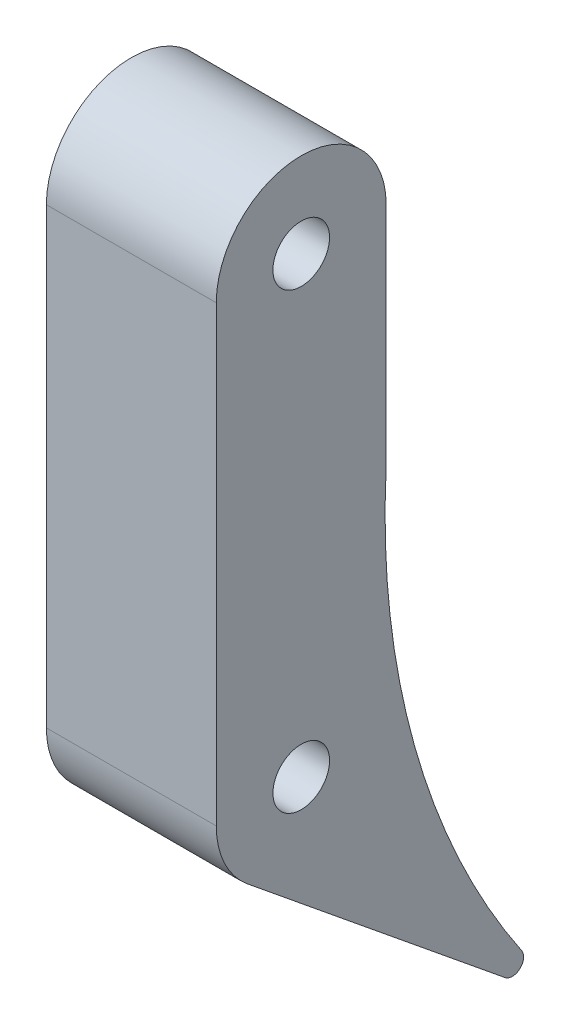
ISO-10303-21;
HEADER;
FILE_DESCRIPTION(('STEP AP214'),'2;1');
FILE_NAME('part.step','',(''),(''),'','','');
FILE_SCHEMA(('AUTOMOTIVE_DESIGN { 1 0 10303 214 1 1 1 1 }'));
ENDSEC;
DATA;
#1=APPLICATION_CONTEXT('core data for automotive mechanical design processes');
#2=APPLICATION_PROTOCOL_DEFINITION('international standard','automotive_design',2000,#1);
#3=PRODUCT_CONTEXT('',#1,'mechanical');
#4=PRODUCT('Part','Part','',(#3));
#5=PRODUCT_RELATED_PRODUCT_CATEGORY('part','',(#4));
#6=PRODUCT_DEFINITION_FORMATION('','',#4);
#7=PRODUCT_DEFINITION_CONTEXT('part definition',#1,'design');
#8=PRODUCT_DEFINITION('design','',#6,#7);
#9=PRODUCT_DEFINITION_SHAPE('','',#8);
#10=(LENGTH_UNIT() NAMED_UNIT(*) SI_UNIT(.MILLI.,.METRE.));
#11=(NAMED_UNIT(*) PLANE_ANGLE_UNIT() SI_UNIT($,.RADIAN.));
#12=(NAMED_UNIT(*) SI_UNIT($,.STERADIAN.) SOLID_ANGLE_UNIT());
#13=UNCERTAINTY_MEASURE_WITH_UNIT(LENGTH_MEASURE(1.E-05),#10,'distance_accuracy_value','');
#14=(GEOMETRIC_REPRESENTATION_CONTEXT(3) GLOBAL_UNCERTAINTY_ASSIGNED_CONTEXT((#13)) GLOBAL_UNIT_ASSIGNED_CONTEXT((#10,
#11,#12)) REPRESENTATION_CONTEXT('',''));
#15=CARTESIAN_POINT('',(0.,0.,0.));
#16=DIRECTION('',(0.,0.,1.));
#17=DIRECTION('',(1.,0.,0.));
#18=AXIS2_PLACEMENT_3D('',#15,#16,#17);
#19=CARTESIAN_POINT('',(7.5,0.,0.));
#20=DIRECTION('',(-1.,0.,0.));
#21=DIRECTION('',(0.,0.,1.));
#22=AXIS2_PLACEMENT_3D('',#19,#20,#21);
#23=PLANE('',#22);
#24=CARTESIAN_POINT('',(7.5,16.2707481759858,-77.4005914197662));
#25=DIRECTION('',(-1.,0.,0.));
#26=DIRECTION('',(0.,0.,1.));
#27=AXIS2_PLACEMENT_3D('',#24,#25,#26);
#28=CIRCLE('',#27,70.);
#29=CARTESIAN_POINT('',(7.5,-23.0123879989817,-19.4623897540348));
#30=VERTEX_POINT('',#29);
#31=CARTESIAN_POINT('',(7.5,19.7592987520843,-7.48757392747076));
#32=VERTEX_POINT('',#31);
#33=EDGE_CURVE('E110',#30,#32,#28,.T.);
#34=ORIENTED_EDGE('',*,*,#33,.T.);
#35=CARTESIAN_POINT('',(7.5,20.2576631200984,2.5));
#36=DIRECTION('',(-1.,0.,0.));
#37=DIRECTION('',(0.,0.,1.));
#38=AXIS2_PLACEMENT_3D('',#35,#36,#37);
#39=CIRCLE('',#38,10.);
#40=CARTESIAN_POINT('',(7.5,20.2576631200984,-7.5));
#41=VERTEX_POINT('',#40);
#42=EDGE_CURVE('E11',#32,#41,#39,.F.);
#43=ORIENTED_EDGE('',*,*,#42,.T.);
#44=DIRECTION('',(0.,1.,0.));
#45=VECTOR('',#44,1.);
#46=CARTESIAN_POINT('',(7.5,40.,-7.5));
#47=LINE('',#46,#45);
#48=CARTESIAN_POINT('',(7.5,40.,-7.5));
#49=VERTEX_POINT('',#48);
#50=EDGE_CURVE('E149',#41,#49,#47,.T.);
#51=ORIENTED_EDGE('',*,*,#50,.T.);
#52=CARTESIAN_POINT('',(7.5,40.,0.));
#53=DIRECTION('',(1.,0.,0.));
#54=DIRECTION('',(0.,0.,-1.));
#55=AXIS2_PLACEMENT_3D('',#52,#53,#54);
#56=CIRCLE('',#55,7.5);
#57=CARTESIAN_POINT('',(7.5,40.,7.5));
#58=VERTEX_POINT('',#57);
#59=EDGE_CURVE('E179',#49,#58,#56,.T.);
#60=ORIENTED_EDGE('',*,*,#59,.T.);
#61=DIRECTION('',(0.,-1.,0.));
#62=VECTOR('',#61,1.);
#63=CARTESIAN_POINT('',(7.5,0.,7.5));
#64=LINE('',#63,#62);
#65=CARTESIAN_POINT('',(7.5,0.,7.5));
#66=VERTEX_POINT('',#65);
#67=EDGE_CURVE('E116',#58,#66,#64,.T.);
#68=ORIENTED_EDGE('',*,*,#67,.T.);
#69=CARTESIAN_POINT('',(7.5,0.,0.));
#70=DIRECTION('',(1.,0.,0.));
#71=DIRECTION('',(0.,0.,1.));
#72=AXIS2_PLACEMENT_3D('',#69,#70,#71);
#73=CIRCLE('',#72,7.49999999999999);
#74=CARTESIAN_POINT('',(7.5,-5.81361253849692,4.73834456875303));
#75=VERTEX_POINT('',#74);
#76=EDGE_CURVE('E111',#66,#75,#73,.T.);
#77=ORIENTED_EDGE('',*,*,#76,.T.);
#78=DIRECTION('',(0.,-0.631779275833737,-0.775148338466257));
#79=VECTOR('',#78,1.);
#80=CARTESIAN_POINT('',(7.5,-29.8212250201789,-24.7172922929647));
#81=LINE('',#80,#79);
#82=CARTESIAN_POINT('',(7.5,-24.3487239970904,-18.0029218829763));
#83=VERTEX_POINT('',#82);
#84=EDGE_CURVE('E99',#75,#83,#81,.T.);
#85=ORIENTED_EDGE('',*,*,#84,.T.);
#86=CARTESIAN_POINT('',(7.5,-23.5735756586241,-18.6347011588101));
#87=DIRECTION('',(-1.,0.,0.));
#88=DIRECTION('',(0.,0.,1.));
#89=AXIS2_PLACEMENT_3D('',#86,#87,#88);
#90=CIRCLE('',#89,1.);
#91=EDGE_CURVE('E138',#83,#30,#90,.F.);
#92=ORIENTED_EDGE('',*,*,#91,.T.);
#93=EDGE_LOOP('',(#34,#43,#51,#60,#68,#77,#85,#92));
#94=FACE_BOUND('',#93,.T.);
#95=CARTESIAN_POINT('',(7.5,0.,0.));
#96=DIRECTION('',(1.,0.,0.));
#97=DIRECTION('',(0.,0.,-1.));
#98=AXIS2_PLACEMENT_3D('',#95,#96,#97);
#99=CIRCLE('',#98,2.5);
#100=CARTESIAN_POINT('',(7.5,0.,-2.49999999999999));
#101=VERTEX_POINT('',#100);
#102=EDGE_CURVE('E172',#101,#101,#99,.T.);
#103=ORIENTED_EDGE('',*,*,#102,.F.);
#104=EDGE_LOOP('',(#103));
#105=FACE_BOUND('',#104,.T.);
#106=CARTESIAN_POINT('',(7.5,40.,0.));
#107=DIRECTION('',(1.,0.,0.));
#108=DIRECTION('',(0.,0.,-1.));
#109=AXIS2_PLACEMENT_3D('',#106,#107,#108);
#110=CIRCLE('',#109,2.5);
#111=CARTESIAN_POINT('',(7.5,40.,-2.5));
#112=VERTEX_POINT('',#111);
#113=EDGE_CURVE('E184',#112,#112,#110,.T.);
#114=ORIENTED_EDGE('',*,*,#113,.F.);
#115=EDGE_LOOP('',(#114));
#116=FACE_BOUND('',#115,.T.);
#117=ADVANCED_FACE('F34',(#94,#105,#116),#23,.F.);
#118=CARTESIAN_POINT('',(-7.5,0.,0.));
#119=DIRECTION('',(-1.,0.,0.));
#120=DIRECTION('',(0.,0.,1.));
#121=AXIS2_PLACEMENT_3D('',#118,#119,#120);
#122=PLANE('',#121);
#123=CARTESIAN_POINT('',(-7.5,0.,0.));
#124=DIRECTION('',(1.,0.,0.));
#125=DIRECTION('',(0.,0.,-1.));
#126=AXIS2_PLACEMENT_3D('',#123,#124,#125);
#127=CIRCLE('',#126,2.5);
#128=CARTESIAN_POINT('',(-7.5,0.,-2.49999999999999));
#129=VERTEX_POINT('',#128);
#130=EDGE_CURVE('E175',#129,#129,#127,.T.);
#131=ORIENTED_EDGE('',*,*,#130,.T.);
#132=EDGE_LOOP('',(#131));
#133=FACE_BOUND('',#132,.T.);
#134=DIRECTION('',(0.,1.,0.));
#135=VECTOR('',#134,1.);
#136=CARTESIAN_POINT('',(-7.5,40.,-7.5));
#137=LINE('',#136,#135);
#138=CARTESIAN_POINT('',(-7.5,20.2576631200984,-7.5));
#139=VERTEX_POINT('',#138);
#140=CARTESIAN_POINT('',(-7.5,40.,-7.5));
#141=VERTEX_POINT('',#140);
#142=EDGE_CURVE('E148',#139,#141,#137,.T.);
#143=ORIENTED_EDGE('',*,*,#142,.F.);
#144=CARTESIAN_POINT('',(-7.5,20.2576631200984,2.5));
#145=DIRECTION('',(-1.,0.,0.));
#146=DIRECTION('',(0.,0.,1.));
#147=AXIS2_PLACEMENT_3D('',#144,#145,#146);
#148=CIRCLE('',#147,10.);
#149=CARTESIAN_POINT('',(-7.5,19.7592987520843,-7.48757392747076));
#150=VERTEX_POINT('',#149);
#151=EDGE_CURVE('E56',#139,#150,#148,.T.);
#152=ORIENTED_EDGE('',*,*,#151,.T.);
#153=CARTESIAN_POINT('',(-7.5,16.2707481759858,-77.4005914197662));
#154=DIRECTION('',(-1.,0.,0.));
#155=DIRECTION('',(0.,0.,1.));
#156=AXIS2_PLACEMENT_3D('',#153,#154,#155);
#157=CIRCLE('',#156,70.);
#158=CARTESIAN_POINT('',(-7.5,-23.0123879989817,-19.4623897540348));
#159=VERTEX_POINT('',#158);
#160=EDGE_CURVE('E157',#159,#150,#157,.T.);
#161=ORIENTED_EDGE('',*,*,#160,.F.);
#162=CARTESIAN_POINT('',(-7.5,-23.5735756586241,-18.6347011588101));
#163=DIRECTION('',(-1.,0.,0.));
#164=DIRECTION('',(0.,0.,1.));
#165=AXIS2_PLACEMENT_3D('',#162,#163,#164);
#166=CIRCLE('',#165,1.);
#167=CARTESIAN_POINT('',(-7.5,-24.3487239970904,-18.0029218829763));
#168=VERTEX_POINT('',#167);
#169=EDGE_CURVE('E129',#159,#168,#166,.T.);
#170=ORIENTED_EDGE('',*,*,#169,.T.);
#171=DIRECTION('',(0.,-0.631779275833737,-0.775148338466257));
#172=VECTOR('',#171,1.);
#173=CARTESIAN_POINT('',(-7.5,-29.8212250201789,-24.7172922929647));
#174=LINE('',#173,#172);
#175=CARTESIAN_POINT('',(-7.5,-5.81361253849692,4.73834456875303));
#176=VERTEX_POINT('',#175);
#177=EDGE_CURVE('E160',#176,#168,#174,.T.);
#178=ORIENTED_EDGE('',*,*,#177,.F.);
#179=CARTESIAN_POINT('',(-7.5,0.,0.));
#180=DIRECTION('',(1.,0.,0.));
#181=DIRECTION('',(0.,0.,1.));
#182=AXIS2_PLACEMENT_3D('',#179,#180,#181);
#183=CIRCLE('',#182,7.49999999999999);
#184=CARTESIAN_POINT('',(-7.5,0.,7.5));
#185=VERTEX_POINT('',#184);
#186=EDGE_CURVE('E124',#185,#176,#183,.T.);
#187=ORIENTED_EDGE('',*,*,#186,.F.);
#188=DIRECTION('',(0.,-1.,0.));
#189=VECTOR('',#188,1.);
#190=CARTESIAN_POINT('',(-7.5,0.,7.5));
#191=LINE('',#190,#189);
#192=CARTESIAN_POINT('',(-7.5,40.,7.5));
#193=VERTEX_POINT('',#192);
#194=EDGE_CURVE('E120',#193,#185,#191,.T.);
#195=ORIENTED_EDGE('',*,*,#194,.F.);
#196=CARTESIAN_POINT('',(-7.5,40.,0.));
#197=DIRECTION('',(1.,0.,0.));
#198=DIRECTION('',(0.,0.,-1.));
#199=AXIS2_PLACEMENT_3D('',#196,#197,#198);
#200=CIRCLE('',#199,7.5);
#201=EDGE_CURVE('E156',#141,#193,#200,.T.);
#202=ORIENTED_EDGE('',*,*,#201,.F.);
#203=EDGE_LOOP('',(#143,#152,#161,#170,#178,#187,#195,#202));
#204=FACE_BOUND('',#203,.T.);
#205=CARTESIAN_POINT('',(-7.5,40.,0.));
#206=DIRECTION('',(1.,0.,0.));
#207=DIRECTION('',(0.,0.,-1.));
#208=AXIS2_PLACEMENT_3D('',#205,#206,#207);
#209=CIRCLE('',#208,2.5);
#210=CARTESIAN_POINT('',(-7.5,40.,-2.5));
#211=VERTEX_POINT('',#210);
#212=EDGE_CURVE('E186',#211,#211,#209,.T.);
#213=ORIENTED_EDGE('',*,*,#212,.T.);
#214=EDGE_LOOP('',(#213));
#215=FACE_BOUND('',#214,.T.);
#216=ADVANCED_FACE('F153',(#133,#204,#215),#122,.T.);
#217=CARTESIAN_POINT('',(7.5,0.,0.));
#218=DIRECTION('',(-1.,0.,0.));
#219=DIRECTION('',(0.,0.,1.));
#220=AXIS2_PLACEMENT_3D('',#217,#218,#219);
#221=CYLINDRICAL_SURFACE('',#220,7.49999999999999);
#222=ORIENTED_EDGE('',*,*,#186,.T.);
#223=DIRECTION('',(-1.,0.,0.));
#224=VECTOR('',#223,1.);
#225=CARTESIAN_POINT('',(7.5,-5.81361253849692,4.73834456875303));
#226=LINE('',#225,#224);
#227=EDGE_CURVE('E104',#75,#176,#226,.T.);
#228=ORIENTED_EDGE('',*,*,#227,.F.);
#229=ORIENTED_EDGE('',*,*,#76,.F.);
#230=DIRECTION('',(-1.,0.,0.));
#231=VECTOR('',#230,1.);
#232=CARTESIAN_POINT('',(7.5,0.,7.5));
#233=LINE('',#232,#231);
#234=EDGE_CURVE('E165',#66,#185,#233,.T.);
#235=ORIENTED_EDGE('',*,*,#234,.T.);
#236=EDGE_LOOP('',(#222,#228,#229,#235));
#237=FACE_BOUND('',#236,.T.);
#238=ADVANCED_FACE('F122',(#237),#221,.T.);
#239=CARTESIAN_POINT('',(7.5,-29.8212250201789,-24.7172922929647));
#240=DIRECTION('',(0.,0.775148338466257,-0.631779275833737));
#241=DIRECTION('',(0.,0.631779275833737,0.775148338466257));
#242=AXIS2_PLACEMENT_3D('',#239,#240,#241);
#243=PLANE('',#242);
#244=ORIENTED_EDGE('',*,*,#177,.T.);
#245=DIRECTION('',(-1.,0.,0.));
#246=VECTOR('',#245,1.);
#247=CARTESIAN_POINT('',(7.5,-24.3487239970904,-18.0029218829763));
#248=LINE('',#247,#246);
#249=EDGE_CURVE('E107',#168,#83,#248,.F.);
#250=ORIENTED_EDGE('',*,*,#249,.T.);
#251=ORIENTED_EDGE('',*,*,#84,.F.);
#252=ORIENTED_EDGE('',*,*,#227,.T.);
#253=EDGE_LOOP('',(#244,#250,#251,#252));
#254=FACE_BOUND('',#253,.T.);
#255=ADVANCED_FACE('F102',(#254),#243,.F.);
#256=CARTESIAN_POINT('',(7.5,16.2707481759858,-77.4005914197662));
#257=DIRECTION('',(-1.,0.,0.));
#258=DIRECTION('',(0.,0.,1.));
#259=AXIS2_PLACEMENT_3D('',#256,#257,#258);
#260=CYLINDRICAL_SURFACE('',#259,70.);
#261=ORIENTED_EDGE('',*,*,#160,.T.);
#262=DIRECTION('',(-1.,0.,0.));
#263=VECTOR('',#262,1.);
#264=CARTESIAN_POINT('',(7.5,19.7592987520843,-7.48757392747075));
#265=LINE('',#264,#263);
#266=EDGE_CURVE('E42',#150,#32,#265,.F.);
#267=ORIENTED_EDGE('',*,*,#266,.T.);
#268=ORIENTED_EDGE('',*,*,#33,.F.);
#269=DIRECTION('',(-1.,0.,0.));
#270=VECTOR('',#269,1.);
#271=CARTESIAN_POINT('',(7.5,-23.0123879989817,-19.4623897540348));
#272=LINE('',#271,#270);
#273=EDGE_CURVE('E125',#30,#159,#272,.T.);
#274=ORIENTED_EDGE('',*,*,#273,.T.);
#275=EDGE_LOOP('',(#261,#267,#268,#274));
#276=FACE_BOUND('',#275,.T.);
#277=ADVANCED_FACE('F213',(#276),#260,.F.);
#278=CARTESIAN_POINT('',(7.5,40.,-7.5));
#279=DIRECTION('',(0.,0.,1.));
#280=DIRECTION('',(1.,0.,0.));
#281=AXIS2_PLACEMENT_3D('',#278,#279,#280);
#282=PLANE('',#281);
#283=ORIENTED_EDGE('',*,*,#50,.F.);
#284=DIRECTION('',(-1.,0.,0.));
#285=VECTOR('',#284,1.);
#286=CARTESIAN_POINT('',(7.5,20.2576631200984,-7.5));
#287=LINE('',#286,#285);
#288=EDGE_CURVE('E140',#41,#139,#287,.T.);
#289=ORIENTED_EDGE('',*,*,#288,.T.);
#290=ORIENTED_EDGE('',*,*,#142,.T.);
#291=DIRECTION('',(-1.,0.,0.));
#292=VECTOR('',#291,1.);
#293=CARTESIAN_POINT('',(7.5,40.,-7.5));
#294=LINE('',#293,#292);
#295=EDGE_CURVE('E126',#49,#141,#294,.T.);
#296=ORIENTED_EDGE('',*,*,#295,.F.);
#297=EDGE_LOOP('',(#283,#289,#290,#296));
#298=FACE_BOUND('',#297,.T.);
#299=ADVANCED_FACE('F146',(#298),#282,.F.);
#300=CARTESIAN_POINT('',(7.5,40.,0.));
#301=DIRECTION('',(-1.,0.,0.));
#302=DIRECTION('',(0.,0.,1.));
#303=AXIS2_PLACEMENT_3D('',#300,#301,#302);
#304=CYLINDRICAL_SURFACE('',#303,7.5);
#305=ORIENTED_EDGE('',*,*,#201,.T.);
#306=DIRECTION('',(-1.,0.,0.));
#307=VECTOR('',#306,1.);
#308=CARTESIAN_POINT('',(7.5,40.,7.5));
#309=LINE('',#308,#307);
#310=EDGE_CURVE('E132',#58,#193,#309,.T.);
#311=ORIENTED_EDGE('',*,*,#310,.F.);
#312=ORIENTED_EDGE('',*,*,#59,.F.);
#313=ORIENTED_EDGE('',*,*,#295,.T.);
#314=EDGE_LOOP('',(#305,#311,#312,#313));
#315=FACE_BOUND('',#314,.T.);
#316=ADVANCED_FACE('F208',(#315),#304,.T.);
#317=CARTESIAN_POINT('',(7.5,0.,7.5));
#318=DIRECTION('',(0.,0.,-1.));
#319=DIRECTION('',(-1.,0.,0.));
#320=AXIS2_PLACEMENT_3D('',#317,#318,#319);
#321=PLANE('',#320);
#322=ORIENTED_EDGE('',*,*,#194,.T.);
#323=ORIENTED_EDGE('',*,*,#234,.F.);
#324=ORIENTED_EDGE('',*,*,#67,.F.);
#325=ORIENTED_EDGE('',*,*,#310,.T.);
#326=EDGE_LOOP('',(#322,#323,#324,#325));
#327=FACE_BOUND('',#326,.T.);
#328=ADVANCED_FACE('F169',(#327),#321,.F.);
#329=CARTESIAN_POINT('',(7.5,0.,0.));
#330=DIRECTION('',(-1.,0.,0.));
#331=DIRECTION('',(0.,0.,1.));
#332=AXIS2_PLACEMENT_3D('',#329,#330,#331);
#333=CYLINDRICAL_SURFACE('',#332,2.5);
#334=ORIENTED_EDGE('',*,*,#102,.T.);
#335=EDGE_LOOP('',(#334));
#336=FACE_BOUND('',#335,.T.);
#337=ORIENTED_EDGE('',*,*,#130,.F.);
#338=EDGE_LOOP('',(#337));
#339=FACE_BOUND('',#338,.T.);
#340=ADVANCED_FACE('F203',(#336,#339),#333,.F.);
#341=CARTESIAN_POINT('',(7.5,40.,0.));
#342=DIRECTION('',(-1.,0.,0.));
#343=DIRECTION('',(0.,0.,1.));
#344=AXIS2_PLACEMENT_3D('',#341,#342,#343);
#345=CYLINDRICAL_SURFACE('',#344,2.5);
#346=ORIENTED_EDGE('',*,*,#113,.T.);
#347=EDGE_LOOP('',(#346));
#348=FACE_BOUND('',#347,.T.);
#349=ORIENTED_EDGE('',*,*,#212,.F.);
#350=EDGE_LOOP('',(#349));
#351=FACE_BOUND('',#350,.T.);
#352=ADVANCED_FACE('F192',(#348,#351),#345,.F.);
#353=CARTESIAN_POINT('',(7.5,-23.5735756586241,-18.6347011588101));
#354=DIRECTION('',(-1.,0.,0.));
#355=DIRECTION('',(0.,0.,1.));
#356=AXIS2_PLACEMENT_3D('',#353,#354,#355);
#357=CYLINDRICAL_SURFACE('',#356,1.);
#358=ORIENTED_EDGE('',*,*,#91,.F.);
#359=ORIENTED_EDGE('',*,*,#249,.F.);
#360=ORIENTED_EDGE('',*,*,#169,.F.);
#361=ORIENTED_EDGE('',*,*,#273,.F.);
#362=EDGE_LOOP('',(#358,#359,#360,#361));
#363=FACE_BOUND('',#362,.T.);
#364=ADVANCED_FACE('F219',(#363),#357,.T.);
#365=CARTESIAN_POINT('',(7.5,20.2576631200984,2.5));
#366=DIRECTION('',(-1.,0.,0.));
#367=DIRECTION('',(0.,0.,1.));
#368=AXIS2_PLACEMENT_3D('',#365,#366,#367);
#369=CYLINDRICAL_SURFACE('',#368,10.);
#370=ORIENTED_EDGE('',*,*,#42,.F.);
#371=ORIENTED_EDGE('',*,*,#266,.F.);
#372=ORIENTED_EDGE('',*,*,#151,.F.);
#373=ORIENTED_EDGE('',*,*,#288,.F.);
#374=EDGE_LOOP('',(#370,#371,#372,#373));
#375=FACE_BOUND('',#374,.T.);
#376=ADVANCED_FACE('F36',(#375),#369,.T.);
#377=CLOSED_SHELL('',(#117,#216,#238,#255,#277,#299,#316,#328,#340,#352,#364,#376));
#378=MANIFOLD_SOLID_BREP('B2',#377);
#379=ADVANCED_BREP_SHAPE_REPRESENTATION('',(#18,#378),#14);
#380=SHAPE_DEFINITION_REPRESENTATION(#9,#379);
ENDSEC;
END-ISO-10303-21;
